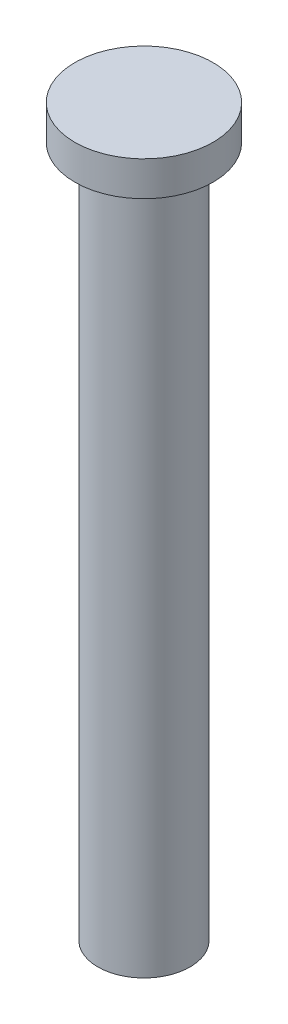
ISO-10303-21;
HEADER;
FILE_DESCRIPTION(('STEP AP214'),'2;1');
FILE_NAME('part.step','',(''),(''),'','','');
FILE_SCHEMA(('AUTOMOTIVE_DESIGN { 1 0 10303 214 1 1 1 1 }'));
ENDSEC;
DATA;
#1=APPLICATION_CONTEXT('core data for automotive mechanical design processes');
#2=APPLICATION_PROTOCOL_DEFINITION('international standard','automotive_design',2000,#1);
#3=PRODUCT_CONTEXT('',#1,'mechanical');
#4=PRODUCT('Part','Part','',(#3));
#5=PRODUCT_RELATED_PRODUCT_CATEGORY('part','',(#4));
#6=PRODUCT_DEFINITION_FORMATION('','',#4);
#7=PRODUCT_DEFINITION_CONTEXT('part definition',#1,'design');
#8=PRODUCT_DEFINITION('design','',#6,#7);
#9=PRODUCT_DEFINITION_SHAPE('','',#8);
#10=(LENGTH_UNIT() NAMED_UNIT(*) SI_UNIT(.MILLI.,.METRE.));
#11=(NAMED_UNIT(*) PLANE_ANGLE_UNIT() SI_UNIT($,.RADIAN.));
#12=(NAMED_UNIT(*) SI_UNIT($,.STERADIAN.) SOLID_ANGLE_UNIT());
#13=UNCERTAINTY_MEASURE_WITH_UNIT(LENGTH_MEASURE(1.E-05),#10,'distance_accuracy_value','');
#14=(GEOMETRIC_REPRESENTATION_CONTEXT(3) GLOBAL_UNCERTAINTY_ASSIGNED_CONTEXT((#13)) GLOBAL_UNIT_ASSIGNED_CONTEXT((#10,
#11,#12)) REPRESENTATION_CONTEXT('',''));
#15=CARTESIAN_POINT('',(0.,0.,0.));
#16=DIRECTION('',(0.,0.,1.));
#17=DIRECTION('',(1.,0.,0.));
#18=AXIS2_PLACEMENT_3D('',#15,#16,#17);
#19=CARTESIAN_POINT('',(0.,60.,0.));
#20=DIRECTION('',(0.,-1.,0.));
#21=DIRECTION('',(0.,0.,-1.));
#22=AXIS2_PLACEMENT_3D('',#19,#20,#21);
#23=CYLINDRICAL_SURFACE('',#22,4.);
#24=CARTESIAN_POINT('',(0.,60.,0.));
#25=DIRECTION('',(0.,1.,0.));
#26=DIRECTION('',(0.,0.,1.));
#27=AXIS2_PLACEMENT_3D('',#24,#25,#26);
#28=CIRCLE('',#27,4.);
#29=CARTESIAN_POINT('',(0.,60.,4.));
#30=VERTEX_POINT('',#29);
#31=EDGE_CURVE('E10',#30,#30,#28,.T.);
#32=ORIENTED_EDGE('',*,*,#31,.F.);
#33=EDGE_LOOP('',(#32));
#34=FACE_BOUND('',#33,.T.);
#35=CARTESIAN_POINT('',(0.,0.,0.));
#36=DIRECTION('',(0.,1.,0.));
#37=DIRECTION('',(0.,0.,1.));
#38=AXIS2_PLACEMENT_3D('',#35,#36,#37);
#39=CIRCLE('',#38,4.);
#40=CARTESIAN_POINT('',(0.,0.,4.));
#41=VERTEX_POINT('',#40);
#42=EDGE_CURVE('E36',#41,#41,#39,.T.);
#43=ORIENTED_EDGE('',*,*,#42,.T.);
#44=EDGE_LOOP('',(#43));
#45=FACE_BOUND('',#44,.T.);
#46=ADVANCED_FACE('F33',(#34,#45),#23,.T.);
#47=CARTESIAN_POINT('',(0.,0.,0.));
#48=DIRECTION('',(0.,1.,0.));
#49=DIRECTION('',(0.,0.,1.));
#50=AXIS2_PLACEMENT_3D('',#47,#48,#49);
#51=PLANE('',#50);
#52=ORIENTED_EDGE('',*,*,#42,.F.);
#53=EDGE_LOOP('',(#52));
#54=FACE_BOUND('',#53,.T.);
#55=ADVANCED_FACE('F56',(#54),#51,.F.);
#56=CARTESIAN_POINT('',(0.,63.,0.));
#57=DIRECTION('',(0.,-1.,0.));
#58=DIRECTION('',(0.,0.,-1.));
#59=AXIS2_PLACEMENT_3D('',#56,#57,#58);
#60=CYLINDRICAL_SURFACE('',#59,6.);
#61=CARTESIAN_POINT('',(0.,63.,0.));
#62=DIRECTION('',(0.,1.,0.));
#63=DIRECTION('',(0.,0.,1.));
#64=AXIS2_PLACEMENT_3D('',#61,#62,#63);
#65=CIRCLE('',#64,6.);
#66=CARTESIAN_POINT('',(0.,63.,6.));
#67=VERTEX_POINT('',#66);
#68=EDGE_CURVE('E43',#67,#67,#65,.T.);
#69=ORIENTED_EDGE('',*,*,#68,.F.);
#70=EDGE_LOOP('',(#69));
#71=FACE_BOUND('',#70,.T.);
#72=CARTESIAN_POINT('',(0.,60.,0.));
#73=DIRECTION('',(0.,1.,0.));
#74=DIRECTION('',(0.,0.,1.));
#75=AXIS2_PLACEMENT_3D('',#72,#73,#74);
#76=CIRCLE('',#75,6.);
#77=CARTESIAN_POINT('',(0.,60.,6.));
#78=VERTEX_POINT('',#77);
#79=EDGE_CURVE('E45',#78,#78,#76,.T.);
#80=ORIENTED_EDGE('',*,*,#79,.T.);
#81=EDGE_LOOP('',(#80));
#82=FACE_BOUND('',#81,.T.);
#83=ADVANCED_FACE('F53',(#71,#82),#60,.T.);
#84=CARTESIAN_POINT('',(0.,63.,0.));
#85=DIRECTION('',(0.,1.,0.));
#86=DIRECTION('',(0.,0.,1.));
#87=AXIS2_PLACEMENT_3D('',#84,#85,#86);
#88=PLANE('',#87);
#89=ORIENTED_EDGE('',*,*,#68,.T.);
#90=EDGE_LOOP('',(#89));
#91=FACE_BOUND('',#90,.T.);
#92=ADVANCED_FACE('F51',(#91),#88,.T.);
#93=CARTESIAN_POINT('',(0.,60.,0.));
#94=DIRECTION('',(0.,1.,0.));
#95=DIRECTION('',(0.,0.,1.));
#96=AXIS2_PLACEMENT_3D('',#93,#94,#95);
#97=PLANE('',#96);
#98=ORIENTED_EDGE('',*,*,#31,.T.);
#99=EDGE_LOOP('',(#98));
#100=FACE_BOUND('',#99,.T.);
#101=ORIENTED_EDGE('',*,*,#79,.F.);
#102=EDGE_LOOP('',(#101));
#103=FACE_BOUND('',#102,.T.);
#104=ADVANCED_FACE('F60',(#100,#103),#97,.F.);
#105=CLOSED_SHELL('',(#46,#55,#83,#92,#104));
#106=MANIFOLD_SOLID_BREP('B2',#105);
#107=ADVANCED_BREP_SHAPE_REPRESENTATION('',(#18,#106),#14);
#108=SHAPE_DEFINITION_REPRESENTATION(#9,#107);
ENDSEC;
END-ISO-10303-21;
